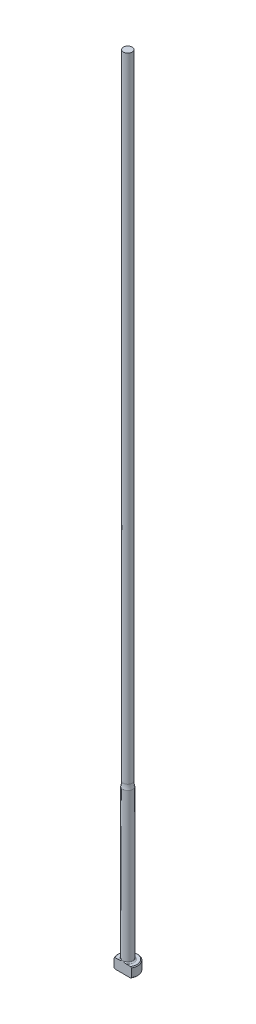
ISO-10303-21;
HEADER;
FILE_DESCRIPTION(('STEP AP214'),'2;1');
FILE_NAME('part.step','',(''),(''),'','','');
FILE_SCHEMA(('AUTOMOTIVE_DESIGN { 1 0 10303 214 1 1 1 1 }'));
ENDSEC;
DATA;
#1=APPLICATION_CONTEXT('core data for automotive mechanical design processes');
#2=APPLICATION_PROTOCOL_DEFINITION('international standard','automotive_design',2000,#1);
#3=PRODUCT_CONTEXT('',#1,'mechanical');
#4=PRODUCT('Part','Part','',(#3));
#5=PRODUCT_RELATED_PRODUCT_CATEGORY('part','',(#4));
#6=PRODUCT_DEFINITION_FORMATION('','',#4);
#7=PRODUCT_DEFINITION_CONTEXT('part definition',#1,'design');
#8=PRODUCT_DEFINITION('design','',#6,#7);
#9=PRODUCT_DEFINITION_SHAPE('','',#8);
#10=(LENGTH_UNIT() NAMED_UNIT(*) SI_UNIT(.MILLI.,.METRE.));
#11=(NAMED_UNIT(*) PLANE_ANGLE_UNIT() SI_UNIT($,.RADIAN.));
#12=(NAMED_UNIT(*) SI_UNIT($,.STERADIAN.) SOLID_ANGLE_UNIT());
#13=UNCERTAINTY_MEASURE_WITH_UNIT(LENGTH_MEASURE(1.E-05),#10,'distance_accuracy_value','');
#14=(GEOMETRIC_REPRESENTATION_CONTEXT(3) GLOBAL_UNCERTAINTY_ASSIGNED_CONTEXT((#13)) GLOBAL_UNIT_ASSIGNED_CONTEXT((#10,
#11,#12)) REPRESENTATION_CONTEXT('',''));
#15=CARTESIAN_POINT('',(0.,0.,0.));
#16=DIRECTION('',(0.,0.,1.));
#17=DIRECTION('',(1.,0.,0.));
#18=AXIS2_PLACEMENT_3D('',#15,#16,#17);
#19=CARTESIAN_POINT('',(-1.38810999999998,254.,0.));
#20=DIRECTION('',(0.,1.,0.));
#21=DIRECTION('',(0.,0.,1.));
#22=AXIS2_PLACEMENT_3D('',#19,#20,#21);
#23=PLANE('',#22);
#24=CARTESIAN_POINT('',(0.,254.,0.));
#25=DIRECTION('',(0.,1.,0.));
#26=DIRECTION('',(0.,0.,1.));
#27=AXIS2_PLACEMENT_3D('',#24,#25,#26);
#28=CIRCLE('',#27,1.38810999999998);
#29=CARTESIAN_POINT('',(0.,254.,1.38810999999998));
#30=VERTEX_POINT('',#29);
#31=EDGE_CURVE('E169',#30,#30,#28,.T.);
#32=ORIENTED_EDGE('',*,*,#31,.T.);
#33=EDGE_LOOP('',(#32));
#34=FACE_BOUND('',#33,.T.);
#35=ADVANCED_FACE('F37',(#34),#23,.T.);
#36=CARTESIAN_POINT('',(0.,259.958771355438,0.));
#37=DIRECTION('',(0.,1.,0.));
#38=DIRECTION('',(0.,0.,1.));
#39=AXIS2_PLACEMENT_3D('',#36,#37,#38);
#40=CYLINDRICAL_SURFACE('',#39,1.38810999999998);
#41=CARTESIAN_POINT('',(0.,52.3787642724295,0.));
#42=DIRECTION('',(0.,1.,0.));
#43=DIRECTION('',(0.,0.,1.));
#44=AXIS2_PLACEMENT_3D('',#41,#42,#43);
#45=CIRCLE('',#44,1.38810999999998);
#46=CARTESIAN_POINT('',(0.,52.3787642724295,1.38810999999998));
#47=VERTEX_POINT('',#46);
#48=EDGE_CURVE('E172',#47,#47,#45,.T.);
#49=ORIENTED_EDGE('',*,*,#48,.T.);
#50=EDGE_LOOP('',(#49));
#51=FACE_BOUND('',#50,.T.);
#52=ORIENTED_EDGE('',*,*,#31,.F.);
#53=EDGE_LOOP('',(#52));
#54=FACE_BOUND('',#53,.T.);
#55=ADVANCED_FACE('F160',(#51,#54),#40,.T.);
#56=CARTESIAN_POINT('',(0.,52.3787642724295,0.));
#57=DIRECTION('',(0.,1.,0.));
#58=DIRECTION('',(0.,0.,1.));
#59=AXIS2_PLACEMENT_3D('',#56,#57,#58);
#60=TOROIDAL_SURFACE('',#59,7.73810999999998,6.35);
#61=CARTESIAN_POINT('',(0.,50.8,0.));
#62=DIRECTION('',(0.,1.,0.));
#63=DIRECTION('',(0.,0.,1.));
#64=AXIS2_PLACEMENT_3D('',#61,#62,#63);
#65=CIRCLE('',#64,1.58749999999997);
#66=CARTESIAN_POINT('',(0.,50.8,1.58749999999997));
#67=VERTEX_POINT('',#66);
#68=EDGE_CURVE('E100',#67,#67,#65,.T.);
#69=ORIENTED_EDGE('',*,*,#68,.T.);
#70=EDGE_LOOP('',(#69));
#71=FACE_BOUND('',#70,.T.);
#72=ORIENTED_EDGE('',*,*,#48,.F.);
#73=EDGE_LOOP('',(#72));
#74=FACE_BOUND('',#73,.T.);
#75=ADVANCED_FACE('F165',(#71,#74),#60,.F.);
#76=CARTESIAN_POINT('',(0.,259.958771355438,0.));
#77=DIRECTION('',(0.,1.,0.));
#78=DIRECTION('',(0.,0.,1.));
#79=AXIS2_PLACEMENT_3D('',#76,#77,#78);
#80=CYLINDRICAL_SURFACE('',#79,1.58749999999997);
#81=CARTESIAN_POINT('',(0.,3.556,0.));
#82=DIRECTION('',(0.,1.,0.));
#83=DIRECTION('',(0.,0.,1.));
#84=AXIS2_PLACEMENT_3D('',#81,#82,#83);
#85=CIRCLE('',#84,1.58749999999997);
#86=CARTESIAN_POINT('',(0.,3.556,1.58749999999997));
#87=VERTEX_POINT('',#86);
#88=EDGE_CURVE('E109',#87,#87,#85,.T.);
#89=ORIENTED_EDGE('',*,*,#88,.T.);
#90=EDGE_LOOP('',(#89));
#91=FACE_BOUND('',#90,.T.);
#92=ORIENTED_EDGE('',*,*,#68,.F.);
#93=EDGE_LOOP('',(#92));
#94=FACE_BOUND('',#93,.T.);
#95=ADVANCED_FACE('F192',(#91,#94),#80,.T.);
#96=CARTESIAN_POINT('',(-3.17499999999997,3.175,0.));
#97=DIRECTION('',(0.,1.,0.));
#98=DIRECTION('',(0.,0.,1.));
#99=AXIS2_PLACEMENT_3D('',#96,#97,#98);
#100=PLANE('',#99);
#101=DIRECTION('',(-1.,0.,0.));
#102=VECTOR('',#101,1.);
#103=CARTESIAN_POINT('',(-3.17499999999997,3.175,1.58749999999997));
#104=LINE('',#103,#102);
#105=CARTESIAN_POINT('',(2.45195529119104,3.175,1.58749999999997));
#106=VERTEX_POINT('',#105);
#107=CARTESIAN_POINT('',(1.16397422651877,3.175,1.58749999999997));
#108=VERTEX_POINT('',#107);
#109=EDGE_CURVE('E58',#106,#108,#104,.T.);
#110=ORIENTED_EDGE('',*,*,#109,.F.);
#111=CARTESIAN_POINT('',(0.,3.175,0.));
#112=DIRECTION('',(0.,1.,0.));
#113=DIRECTION('',(0.,0.,1.));
#114=AXIS2_PLACEMENT_3D('',#111,#112,#113);
#115=CIRCLE('',#114,2.92099999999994);
#116=CARTESIAN_POINT('',(-2.45195529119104,3.175,1.58749999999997));
#117=VERTEX_POINT('',#116);
#118=EDGE_CURVE('E171',#106,#117,#115,.T.);
#119=ORIENTED_EDGE('',*,*,#118,.T.);
#120=CARTESIAN_POINT('',(-1.16397422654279,3.175,1.58749999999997));
#121=VERTEX_POINT('',#120);
#122=EDGE_CURVE('E140',#121,#117,#104,.T.);
#123=ORIENTED_EDGE('',*,*,#122,.F.);
#124=CARTESIAN_POINT('',(0.,3.175,0.));
#125=DIRECTION('',(0.,1.,0.));
#126=DIRECTION('',(0.,0.,1.));
#127=AXIS2_PLACEMENT_3D('',#124,#125,#126);
#128=CIRCLE('',#127,1.96849999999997);
#129=EDGE_CURVE('E113',#121,#108,#128,.F.);
#130=ORIENTED_EDGE('',*,*,#129,.T.);
#131=EDGE_LOOP('',(#110,#119,#123,#130));
#132=FACE_BOUND('',#131,.T.);
#133=ADVANCED_FACE('F189',(#132),#100,.T.);
#134=CARTESIAN_POINT('',(0.,259.958771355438,0.));
#135=DIRECTION('',(0.,1.,0.));
#136=DIRECTION('',(0.,0.,1.));
#137=AXIS2_PLACEMENT_3D('',#134,#135,#136);
#138=CYLINDRICAL_SURFACE('',#137,3.17499999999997);
#139=DIRECTION('',(0.,-1.,0.));
#140=VECTOR('',#139,1.);
#141=CARTESIAN_POINT('',(-2.74963065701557,254.,1.58749999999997));
#142=LINE('',#141,#140);
#143=CARTESIAN_POINT('',(-2.74963065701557,2.92100000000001,1.58749999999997));
#144=VERTEX_POINT('',#143);
#145=CARTESIAN_POINT('',(-2.74963065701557,0.253999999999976,1.58749999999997));
#146=VERTEX_POINT('',#145);
#147=EDGE_CURVE('E95',#144,#146,#142,.T.);
#148=ORIENTED_EDGE('',*,*,#147,.F.);
#149=CARTESIAN_POINT('',(0.,2.92100000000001,0.));
#150=DIRECTION('',(0.,1.,0.));
#151=DIRECTION('',(0.,0.,1.));
#152=AXIS2_PLACEMENT_3D('',#149,#150,#151);
#153=CIRCLE('',#152,3.17499999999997);
#154=CARTESIAN_POINT('',(2.74963065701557,2.92100000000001,1.58749999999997));
#155=VERTEX_POINT('',#154);
#156=EDGE_CURVE('E110',#144,#155,#153,.F.);
#157=ORIENTED_EDGE('',*,*,#156,.T.);
#158=DIRECTION('',(0.,-1.,0.));
#159=VECTOR('',#158,1.);
#160=CARTESIAN_POINT('',(2.74963065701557,254.,1.58749999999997));
#161=LINE('',#160,#159);
#162=CARTESIAN_POINT('',(2.74963065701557,0.253999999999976,1.58749999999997));
#163=VERTEX_POINT('',#162);
#164=EDGE_CURVE('E182',#155,#163,#161,.T.);
#165=ORIENTED_EDGE('',*,*,#164,.T.);
#166=CARTESIAN_POINT('',(0.,0.253999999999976,0.));
#167=DIRECTION('',(0.,-1.,0.));
#168=DIRECTION('',(0.,0.,-1.));
#169=AXIS2_PLACEMENT_3D('',#166,#167,#168);
#170=CIRCLE('',#169,3.17499999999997);
#171=EDGE_CURVE('E116',#163,#146,#170,.F.);
#172=ORIENTED_EDGE('',*,*,#171,.T.);
#173=EDGE_LOOP('',(#148,#157,#165,#172));
#174=FACE_BOUND('',#173,.T.);
#175=ADVANCED_FACE('F180',(#174),#138,.T.);
#176=CARTESIAN_POINT('',(0.,0.,0.));
#177=DIRECTION('',(0.,-1.,0.));
#178=DIRECTION('',(0.,0.,-1.));
#179=AXIS2_PLACEMENT_3D('',#176,#177,#178);
#180=PLANE('',#179);
#181=DIRECTION('',(1.,0.,0.));
#182=VECTOR('',#181,1.);
#183=CARTESIAN_POINT('',(-2.74963065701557,0.,1.58749999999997));
#184=LINE('',#183,#182);
#185=CARTESIAN_POINT('',(-2.45195529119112,0.,1.58749999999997));
#186=VERTEX_POINT('',#185);
#187=CARTESIAN_POINT('',(2.45195529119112,0.,1.58749999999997));
#188=VERTEX_POINT('',#187);
#189=EDGE_CURVE('E92',#186,#188,#184,.T.);
#190=ORIENTED_EDGE('',*,*,#189,.F.);
#191=CARTESIAN_POINT('',(0.,0.,0.));
#192=DIRECTION('',(0.,-1.,0.));
#193=DIRECTION('',(0.,0.,-1.));
#194=AXIS2_PLACEMENT_3D('',#191,#192,#193);
#195=CIRCLE('',#194,2.92100000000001);
#196=EDGE_CURVE('E106',#186,#188,#195,.T.);
#197=ORIENTED_EDGE('',*,*,#196,.T.);
#198=EDGE_LOOP('',(#190,#197));
#199=FACE_BOUND('',#198,.T.);
#200=ADVANCED_FACE('F105',(#199),#180,.T.);
#201=CARTESIAN_POINT('',(0.,3.17499999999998,0.));
#202=DIRECTION('',(0.,-1.,0.));
#203=DIRECTION('',(0.,0.,-1.));
#204=AXIS2_PLACEMENT_3D('',#201,#202,#203);
#205=CONICAL_SURFACE('',#204,2.92099999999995,0.785398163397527);
#206=CARTESIAN_POINT('',(2.75033065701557,2.9203937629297,1.58749999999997));
#207=CARTESIAN_POINT('',(2.66887796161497,2.99091042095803,1.58749999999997));
#208=CARTESIAN_POINT('',(2.58705989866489,3.0610138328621,1.58749999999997));
#209=CARTESIAN_POINT('',(2.42241022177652,3.20009957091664,1.58749999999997));
#210=CARTESIAN_POINT('',(2.33957813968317,3.26908134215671,1.58749999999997));
#211=CARTESIAN_POINT('',(2.17073968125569,3.40716024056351,1.58749999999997));
#212=CARTESIAN_POINT('',(2.08470440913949,3.47622217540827,1.58749999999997));
#213=CARTESIAN_POINT('',(1.91099881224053,3.61222325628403,1.58749999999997));
#214=CARTESIAN_POINT('',(1.82332890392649,3.67916293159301,1.58749999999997));
#215=CARTESIAN_POINT('',(1.64569223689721,3.8102066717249,1.58749999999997));
#216=CARTESIAN_POINT('',(1.55572245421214,3.8743066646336,1.58749999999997));
#217=CARTESIAN_POINT('',(1.37280394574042,3.99833089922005,1.58749999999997));
#218=CARTESIAN_POINT('',(1.27985285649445,4.05825170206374,1.58749999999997));
#219=CARTESIAN_POINT('',(1.09086561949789,4.17130826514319,1.58749999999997));
#220=CARTESIAN_POINT('',(0.994859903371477,4.22449421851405,1.58749999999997));
#221=CARTESIAN_POINT('',(0.798114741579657,4.32122233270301,1.58749999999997));
#222=CARTESIAN_POINT('',(0.697384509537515,4.36478238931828,1.58749999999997));
#223=CARTESIAN_POINT('',(0.541185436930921,4.41951656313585,1.58749999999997));
#224=CARTESIAN_POINT('',(0.487627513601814,4.43611950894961,1.58749999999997));
#225=CARTESIAN_POINT('',(0.379267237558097,4.46466012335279,1.58749999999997));
#226=CARTESIAN_POINT('',(0.324465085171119,4.4765985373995,1.58749999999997));
#227=CARTESIAN_POINT('',(0.214272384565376,4.49501904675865,1.58749999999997));
#228=CARTESIAN_POINT('',(0.158887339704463,4.50153345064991,1.58749999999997));
#229=CARTESIAN_POINT('',(0.047736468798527,4.5087502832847,1.58749999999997));
#230=CARTESIAN_POINT('',(-0.00802931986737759,4.50945327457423,1.58749999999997));
#231=CARTESIAN_POINT('',(-0.119372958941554,4.50499163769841,1.58749999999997));
#232=CARTESIAN_POINT('',(-0.174950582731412,4.49982147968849,1.58749999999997));
#233=CARTESIAN_POINT('',(-0.285312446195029,4.48399101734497,1.58749999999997));
#234=CARTESIAN_POINT('',(-0.340096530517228,4.4733296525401,1.58749999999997));
#235=CARTESIAN_POINT('',(-0.448865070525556,4.44711334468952,1.58749999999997));
#236=CARTESIAN_POINT('',(-0.502841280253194,4.43152477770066,1.58749999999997));
#237=CARTESIAN_POINT('',(-0.609429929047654,4.39628553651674,1.58749999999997));
#238=CARTESIAN_POINT('',(-0.662042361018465,4.37663484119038,1.58749999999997));
#239=CARTESIAN_POINT('',(-0.778129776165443,4.32902110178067,1.58749999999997));
#240=CARTESIAN_POINT('',(-0.841245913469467,4.30019026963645,1.58749999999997));
#241=CARTESIAN_POINT('',(-0.96559457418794,4.23868811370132,1.58749999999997));
#242=CARTESIAN_POINT('',(-1.02682597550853,4.20601455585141,1.58749999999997));
#243=CARTESIAN_POINT('',(-1.14774341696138,4.13769010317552,1.58749999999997));
#244=CARTESIAN_POINT('',(-1.20742632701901,4.10203371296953,1.58749999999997));
#245=CARTESIAN_POINT('',(-1.32539130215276,4.02846531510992,1.58749999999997));
#246=CARTESIAN_POINT('',(-1.38367308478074,3.99055285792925,1.58749999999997));
#247=CARTESIAN_POINT('',(-1.55734442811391,3.87382704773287,1.58749999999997));
#248=CARTESIAN_POINT('',(-1.6709584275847,3.79237897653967,1.58749999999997));
#249=CARTESIAN_POINT('',(-1.89475235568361,3.62521862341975,1.58749999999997));
#250=CARTESIAN_POINT('',(-2.00493591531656,3.53951111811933,1.58749999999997));
#251=CARTESIAN_POINT('',(-2.22248693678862,3.36554942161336,1.58749999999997));
#252=CARTESIAN_POINT('',(-2.32986450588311,3.27730782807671,1.58749999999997));
#253=CARTESIAN_POINT('',(-2.48909538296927,3.14389342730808,1.58749999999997));
#254=CARTESIAN_POINT('',(-2.54159338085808,3.09948435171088,1.58749999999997));
#255=CARTESIAN_POINT('',(-2.64622282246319,3.01024124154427,1.58749999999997));
#256=CARTESIAN_POINT('',(-2.69835428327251,2.96540722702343,1.58749999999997));
#257=CARTESIAN_POINT('',(-2.75033065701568,2.92039376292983,1.58749999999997));
#258=B_SPLINE_CURVE_WITH_KNOTS('',3,(#206,#207,#208,#209,#210,#211,#212,#213,#214,#215,#216,
#217,#218,#219,#220,#221,#222,#223,#224,#225,#226,#227,#228,#229,#230,#231,#232,#233,#234,#235,
#236,#237,#238,#239,#240,#241,#242,#243,#244,#245,#246,#247,#248,#249,#250,#251,#252,#253,#254,
#255,#256,#257),.UNSPECIFIED.,.F.,.F.,(4,2,2,2,2,2,2,2,2,2,2,2,2,2,2,2,2,2,2,2,2,2,2,2,2,4),(0.,
0.323216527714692,0.64658837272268,0.97753957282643,1.30840757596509,1.639735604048,
1.97133312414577,2.30029221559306,2.62863448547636,2.79668277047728,2.96470418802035,
3.13171746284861,3.29871457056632,3.46586904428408,3.63305581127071,3.80140905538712,
3.96976317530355,4.17775353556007,4.38586541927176,4.59436953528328,4.80291533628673,
5.22209642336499,5.64081759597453,6.0577303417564,6.26401477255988,6.47028951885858),.UNSPECIFIED.);
#259=EDGE_CURVE('E63',#155,#106,#258,.T.);
#260=ORIENTED_EDGE('',*,*,#259,.F.);
#261=ORIENTED_EDGE('',*,*,#156,.F.);
#262=EDGE_CURVE('E133',#117,#144,#258,.T.);
#263=ORIENTED_EDGE('',*,*,#262,.F.);
#264=ORIENTED_EDGE('',*,*,#118,.F.);
#265=EDGE_LOOP('',(#260,#261,#263,#264));
#266=FACE_BOUND('',#265,.T.);
#267=ADVANCED_FACE('F147',(#266),#205,.T.);
#268=CARTESIAN_POINT('',(0.,0.253999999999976,0.));
#269=DIRECTION('',(0.,1.,0.));
#270=DIRECTION('',(0.,0.,1.));
#271=AXIS2_PLACEMENT_3D('',#268,#269,#270);
#272=CONICAL_SURFACE('',#271,3.17499999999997,0.785398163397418);
#273=CARTESIAN_POINT('',(-2.75033065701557,0.254606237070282,1.58749999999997));
#274=CARTESIAN_POINT('',(-2.66887796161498,0.184089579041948,1.58749999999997));
#275=CARTESIAN_POINT('',(-2.58705989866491,0.113986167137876,1.58749999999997));
#276=CARTESIAN_POINT('',(-2.42241022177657,-0.0250995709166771,1.58749999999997));
#277=CARTESIAN_POINT('',(-2.33957813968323,-0.0940813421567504,1.58749999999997));
#278=CARTESIAN_POINT('',(-2.17073968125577,-0.232160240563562,1.58749999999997));
#279=CARTESIAN_POINT('',(-2.08470440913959,-0.301222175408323,1.58749999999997));
#280=CARTESIAN_POINT('',(-1.91099881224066,-0.437223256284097,1.58749999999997));
#281=CARTESIAN_POINT('',(-1.82332890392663,-0.50416293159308,1.58749999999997));
#282=CARTESIAN_POINT('',(-1.64569223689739,-0.635206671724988,1.58749999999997));
#283=CARTESIAN_POINT('',(-1.55572245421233,-0.699306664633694,1.58749999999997));
#284=CARTESIAN_POINT('',(-1.37280394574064,-0.823330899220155,1.58749999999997));
#285=CARTESIAN_POINT('',(-1.27985285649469,-0.883251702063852,1.58749999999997));
#286=CARTESIAN_POINT('',(-1.09086561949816,-0.996308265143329,1.58749999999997));
#287=CARTESIAN_POINT('',(-0.994859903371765,-1.0494942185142,1.58749999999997));
#288=CARTESIAN_POINT('',(-0.798114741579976,-1.14622233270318,1.58749999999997));
#289=CARTESIAN_POINT('',(-0.697384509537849,-1.18978238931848,1.58749999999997));
#290=CARTESIAN_POINT('',(-0.54118543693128,-1.24451656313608,1.58749999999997));
#291=CARTESIAN_POINT('',(-0.487627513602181,-1.26111950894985,1.58749999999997));
#292=CARTESIAN_POINT('',(-0.379267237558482,-1.28966012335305,1.58749999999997));
#293=CARTESIAN_POINT('',(-0.324465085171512,-1.30159853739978,1.58749999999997));
#294=CARTESIAN_POINT('',(-0.214272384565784,-1.32001904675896,1.58749999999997));
#295=CARTESIAN_POINT('',(-0.158887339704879,-1.32653345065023,1.58749999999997));
#296=CARTESIAN_POINT('',(-0.0477364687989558,-1.33375028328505,1.58749999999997));
#297=CARTESIAN_POINT('',(0.00802931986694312,-1.33445327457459,1.58749999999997));
#298=CARTESIAN_POINT('',(0.119372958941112,-1.32999163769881,1.58749999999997));
#299=CARTESIAN_POINT('',(0.174950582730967,-1.3248214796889,1.58749999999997));
#300=CARTESIAN_POINT('',(0.28531244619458,-1.30899101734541,1.58749999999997));
#301=CARTESIAN_POINT('',(0.340096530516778,-1.29832965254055,1.58749999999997));
#302=CARTESIAN_POINT('',(0.448865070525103,-1.27211334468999,1.58749999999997));
#303=CARTESIAN_POINT('',(0.50284128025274,-1.25652477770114,1.58749999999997));
#304=CARTESIAN_POINT('',(0.609429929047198,-1.22128553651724,1.58749999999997));
#305=CARTESIAN_POINT('',(0.662042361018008,-1.20163484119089,1.58749999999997));
#306=CARTESIAN_POINT('',(0.778129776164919,-1.15402110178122,1.58749999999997));
#307=CARTESIAN_POINT('',(0.841245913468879,-1.12519026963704,1.58749999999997));
#308=CARTESIAN_POINT('',(0.965594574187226,-1.06368811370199,1.58749999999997));
#309=CARTESIAN_POINT('',(1.02682597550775,-1.03101455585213,1.58749999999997));
#310=CARTESIAN_POINT('',(1.14774341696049,-0.962690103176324,1.58749999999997));
#311=CARTESIAN_POINT('',(1.20742632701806,-0.927033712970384,1.58749999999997));
#312=CARTESIAN_POINT('',(1.32539130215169,-0.85346531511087,1.58749999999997));
#313=CARTESIAN_POINT('',(1.38367308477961,-0.815552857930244,1.58749999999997));
#314=CARTESIAN_POINT('',(1.5573444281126,-0.698827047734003,1.58749999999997));
#315=CARTESIAN_POINT('',(1.67095842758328,-0.617378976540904,1.58749999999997));
#316=CARTESIAN_POINT('',(1.89475235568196,-0.45021862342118,1.58749999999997));
#317=CARTESIAN_POINT('',(2.0049359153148,-0.364511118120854,1.58749999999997));
#318=CARTESIAN_POINT('',(2.22248693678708,-0.19054942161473,1.58749999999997));
#319=CARTESIAN_POINT('',(2.3298645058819,-0.102307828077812,1.58749999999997));
#320=CARTESIAN_POINT('',(2.48909538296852,0.0311065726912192,1.58749999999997));
#321=CARTESIAN_POINT('',(2.54159338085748,0.0755156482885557,1.58749999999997));
#322=CARTESIAN_POINT('',(2.64622282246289,0.16475875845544,1.58749999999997));
#323=CARTESIAN_POINT('',(2.69835428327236,0.209592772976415,1.58749999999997));
#324=CARTESIAN_POINT('',(2.75033065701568,0.254606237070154,1.58749999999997));
#325=B_SPLINE_CURVE_WITH_KNOTS('',3,(#273,#274,#275,#276,#277,#278,#279,#280,#281,#282,#283,
#284,#285,#286,#287,#288,#289,#290,#291,#292,#293,#294,#295,#296,#297,#298,#299,#300,#301,#302,
#303,#304,#305,#306,#307,#308,#309,#310,#311,#312,#313,#314,#315,#316,#317,#318,#319,#320,#321,
#322,#323,#324),.UNSPECIFIED.,.F.,.F.,(4,2,2,2,2,2,2,2,2,2,2,2,2,2,2,2,2,2,2,2,2,2,2,2,2,4),(0.,
0.323216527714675,0.646588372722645,0.977539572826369,1.308407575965,1.63973560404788,
1.97133312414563,2.3002922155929,2.62863448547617,2.79668277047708,2.96470418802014,
3.13171746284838,3.29871457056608,3.46586904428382,3.63305581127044,3.80140905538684,
3.96976317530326,4.17775353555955,4.38586541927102,4.59436953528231,4.80291533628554,
5.22209642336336,5.64081759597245,6.05773034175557,6.26401477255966,6.47028951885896),.UNSPECIFIED.);
#326=EDGE_CURVE('E89',#146,#186,#325,.T.);
#327=ORIENTED_EDGE('',*,*,#326,.F.);
#328=ORIENTED_EDGE('',*,*,#171,.F.);
#329=EDGE_CURVE('E101',#188,#163,#325,.T.);
#330=ORIENTED_EDGE('',*,*,#329,.F.);
#331=ORIENTED_EDGE('',*,*,#196,.F.);
#332=EDGE_LOOP('',(#327,#328,#330,#331));
#333=FACE_BOUND('',#332,.T.);
#334=ADVANCED_FACE('F108',(#333),#272,.T.);
#335=CARTESIAN_POINT('',(0.,3.556,0.));
#336=DIRECTION('',(0.,1.,0.));
#337=DIRECTION('',(0.,0.,1.));
#338=AXIS2_PLACEMENT_3D('',#335,#336,#337);
#339=TOROIDAL_SURFACE('',#338,1.96849999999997,0.381);
#340=ORIENTED_EDGE('',*,*,#129,.F.);
#341=CARTESIAN_POINT('',(0.,3.556,1.58749999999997));
#342=CARTESIAN_POINT('',(-9.72836981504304E-12,3.55600071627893,1.58749999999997));
#343=CARTESIAN_POINT('',(-1.16390048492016E-07,3.55600143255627,1.58749999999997));
#344=CARTESIAN_POINT('',(-5.02802253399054E-07,3.55600282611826,1.58749999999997));
#345=CARTESIAN_POINT('',(-7.75049116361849E-07,3.55600350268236,1.58749999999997));
#346=CARTESIAN_POINT('',(-1.43578185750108E-06,3.5560048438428,1.58749999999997));
#347=CARTESIAN_POINT('',(-1.83004116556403E-06,3.55600550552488,1.58749999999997));
#348=CARTESIAN_POINT('',(-2.69326525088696E-06,3.55600677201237,1.58749999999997));
#349=CARTESIAN_POINT('',(-3.16190628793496E-06,3.55600737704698,1.58749999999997));
#350=CARTESIAN_POINT('',(-4.80183833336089E-06,3.55600933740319,1.58749999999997));
#351=CARTESIAN_POINT('',(-6.07237548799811E-06,3.55601061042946,1.58749999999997));
#352=CARTESIAN_POINT('',(-8.74131694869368E-06,3.55601293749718,1.58749999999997));
#353=CARTESIAN_POINT('',(-1.01362054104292E-05,3.55601399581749,1.58749999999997));
#354=CARTESIAN_POINT('',(-1.54025644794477E-05,3.55601779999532,1.58749999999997));
#355=CARTESIAN_POINT('',(-1.94297992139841E-05,3.55602033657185,1.58749999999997));
#356=CARTESIAN_POINT('',(-2.75116574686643E-05,3.55602464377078,1.58749999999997));
#357=CARTESIAN_POINT('',(-3.15456374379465E-05,3.55602645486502,1.58749999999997));
#358=CARTESIAN_POINT('',(-4.82039076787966E-05,3.55603383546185,1.58749999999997));
#359=CARTESIAN_POINT('',(-6.08993138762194E-05,3.55603922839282,1.58749999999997));
#360=CARTESIAN_POINT('',(-8.49758225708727E-05,3.55604818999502,1.58749999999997));
#361=CARTESIAN_POINT('',(-9.62998311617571E-05,3.55605190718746,1.58749999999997));
#362=CARTESIAN_POINT('',(-0.000176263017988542,3.55608045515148,1.58749999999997));
#363=CARTESIAN_POINT('',(-0.000240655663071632,3.55611569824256,1.58749999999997));
#364=CARTESIAN_POINT('',(-0.000487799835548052,3.55624580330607,1.58749999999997));
#365=CARTESIAN_POINT('',(-0.00067351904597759,3.55633293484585,1.58749999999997));
#366=CARTESIAN_POINT('',(-0.00138308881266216,3.55667103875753,1.58749999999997));
#367=CARTESIAN_POINT('',(-0.00190387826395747,3.55693009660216,1.58749999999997));
#368=CARTESIAN_POINT('',(-0.00399959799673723,3.55796727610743,1.58749999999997));
#369=CARTESIAN_POINT('',(-0.00557790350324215,3.55873636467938,1.58749999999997));
#370=CARTESIAN_POINT('',(-0.0382341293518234,3.57465580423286,1.58749999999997));
#371=CARTESIAN_POINT('',(-0.0692744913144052,3.58990875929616,1.58749999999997));
#372=CARTESIAN_POINT('',(-0.130397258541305,3.61965968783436,1.58749999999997));
#373=CARTESIAN_POINT('',(-0.160476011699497,3.63416561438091,1.58749999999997));
#374=CARTESIAN_POINT('',(-0.224053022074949,3.66443420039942,1.58749999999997));
#375=CARTESIAN_POINT('',(-0.257567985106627,3.68016231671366,1.58749999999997));
#376=CARTESIAN_POINT('',(-0.325196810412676,3.71115684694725,1.58749999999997));
#377=CARTESIAN_POINT('',(-0.359313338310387,3.72641747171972,1.58749999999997));
#378=CARTESIAN_POINT('',(-0.419670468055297,3.75252155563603,1.58749999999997));
#379=CARTESIAN_POINT('',(-0.445832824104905,3.76354497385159,1.58749999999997));
#380=CARTESIAN_POINT('',(-0.498343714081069,3.78496139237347,1.58749999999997));
#381=CARTESIAN_POINT('',(-0.52469168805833,3.79535577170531,1.58749999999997));
#382=CARTESIAN_POINT('',(-0.603098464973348,3.82505921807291,1.58749999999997));
#383=CARTESIAN_POINT('',(-0.655557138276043,3.84334682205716,1.58749999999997));
#384=CARTESIAN_POINT('',(-0.737608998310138,3.86867530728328,1.58749999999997));
#385=CARTESIAN_POINT('',(-0.766787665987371,3.87705653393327,1.58749999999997));
#386=CARTESIAN_POINT('',(-0.825628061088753,3.89250520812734,1.58749999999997));
#387=CARTESIAN_POINT('',(-0.855291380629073,3.89956651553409,1.58749999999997));
#388=CARTESIAN_POINT('',(-0.947623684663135,3.91896724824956,1.58749999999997));
#389=CARTESIAN_POINT('',(-1.01091582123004,3.92863515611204,1.58749999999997));
#390=CARTESIAN_POINT('',(-1.12491727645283,3.93735173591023,1.58749999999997));
#391=CARTESIAN_POINT('',(-1.17548103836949,3.93820257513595,1.58749999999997));
#392=CARTESIAN_POINT('',(-1.2756075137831,3.93219174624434,1.58749999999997));
#393=CARTESIAN_POINT('',(-1.32517446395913,3.92543532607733,1.58749999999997));
#394=CARTESIAN_POINT('',(-1.40268723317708,3.90689937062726,1.58749999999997));
#395=CARTESIAN_POINT('',(-1.43136704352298,3.8982006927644,1.58749999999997));
#396=CARTESIAN_POINT('',(-1.48727388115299,3.87676152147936,1.58749999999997));
#397=CARTESIAN_POINT('',(-1.51449910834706,3.86401614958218,1.58749999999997));
#398=CARTESIAN_POINT('',(-1.56082978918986,3.83720110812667,1.58749999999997));
#399=CARTESIAN_POINT('',(-1.5804296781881,3.82399155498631,1.58749999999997));
#400=CARTESIAN_POINT('',(-1.61726850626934,3.79461258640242,1.58749999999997));
#401=CARTESIAN_POINT('',(-1.63451177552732,3.77844873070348,1.58749999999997));
#402=CARTESIAN_POINT('',(-1.66235366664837,3.74697901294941,1.58749999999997));
#403=CARTESIAN_POINT('',(-1.67358404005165,3.73223408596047,1.58749999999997));
#404=CARTESIAN_POINT('',(-1.69348690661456,3.70109350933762,1.58749999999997));
#405=CARTESIAN_POINT('',(-1.70216040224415,3.68469851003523,1.58749999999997));
#406=CARTESIAN_POINT('',(-1.71647536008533,3.65047412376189,1.58749999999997));
#407=CARTESIAN_POINT('',(-1.72209384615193,3.63263499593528,1.58749999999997));
#408=CARTESIAN_POINT('',(-1.72977101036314,3.59620550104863,1.58749999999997));
#409=CARTESIAN_POINT('',(-1.73183223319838,3.57761568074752,1.58749999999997));
#410=CARTESIAN_POINT('',(-1.73220894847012,3.54269507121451,1.58749999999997));
#411=CARTESIAN_POINT('',(-1.73095378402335,3.52636752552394,1.58749999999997));
#412=CARTESIAN_POINT('',(-1.72566824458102,3.49417280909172,1.58749999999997));
#413=CARTESIAN_POINT('',(-1.72163817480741,3.47830558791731,1.58749999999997));
#414=CARTESIAN_POINT('',(-1.71112762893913,3.44769086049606,1.58749999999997));
#415=CARTESIAN_POINT('',(-1.70468621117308,3.43292978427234,1.58749999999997));
#416=CARTESIAN_POINT('',(-1.68967506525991,3.40454102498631,1.58749999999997));
#417=CARTESIAN_POINT('',(-1.68110458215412,3.39091374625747,1.58749999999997));
#418=CARTESIAN_POINT('',(-1.6586320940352,3.36009164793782,1.58749999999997));
#419=CARTESIAN_POINT('',(-1.64393589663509,3.34347475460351,1.58749999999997));
#420=CARTESIAN_POINT('',(-1.61203006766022,3.31284923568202,1.58749999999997));
#421=CARTESIAN_POINT('',(-1.59481484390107,3.29884657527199,1.58749999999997));
#422=CARTESIAN_POINT('',(-1.55180967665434,3.26864697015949,1.58749999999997));
#423=CARTESIAN_POINT('',(-1.52522183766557,3.25359002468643,1.58749999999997));
#424=CARTESIAN_POINT('',(-1.47008223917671,3.22790710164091,1.58749999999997));
#425=CARTESIAN_POINT('',(-1.44153163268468,3.21727854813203,1.58749999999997));
#426=CARTESIAN_POINT('',(-1.36850699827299,3.19543087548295,1.58749999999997));
#427=CARTESIAN_POINT('',(-1.32330828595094,3.18665188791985,1.58749999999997));
#428=CARTESIAN_POINT('',(-1.23163561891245,3.17601019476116,1.58749999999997));
#429=CARTESIAN_POINT('',(-1.18515271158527,3.17423987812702,1.58749999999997));
#430=CARTESIAN_POINT('',(-1.05662630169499,3.17714275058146,1.58749999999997));
#431=CARTESIAN_POINT('',(-0.974728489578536,3.18781881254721,1.58749999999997));
#432=CARTESIAN_POINT('',(-0.855941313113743,3.21210673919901,1.58749999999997));
#433=CARTESIAN_POINT('',(-0.817952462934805,3.22124962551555,1.58749999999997));
#434=CARTESIAN_POINT('',(-0.742758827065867,3.24165077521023,1.58749999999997));
#435=CARTESIAN_POINT('',(-0.70555083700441,3.25289687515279,1.58749999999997));
#436=CARTESIAN_POINT('',(-0.61890080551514,3.28132261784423,1.58749999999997));
#437=CARTESIAN_POINT('',(-0.569693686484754,3.29920707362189,1.58749999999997));
#438=CARTESIAN_POINT('',(-0.496059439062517,3.32795584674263,1.58749999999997));
#439=CARTESIAN_POINT('',(-0.471293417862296,3.33797105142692,1.58749999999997));
#440=CARTESIAN_POINT('',(-0.421913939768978,3.35852833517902,1.58749999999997));
#441=CARTESIAN_POINT('',(-0.397300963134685,3.36907157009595,1.58749999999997));
#442=CARTESIAN_POINT('',(-0.340371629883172,3.39402532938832,1.58749999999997));
#443=CARTESIAN_POINT('',(-0.308122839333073,3.40858936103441,1.58749999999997));
#444=CARTESIAN_POINT('',(-0.244169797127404,3.43810365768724,1.58749999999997));
#445=CARTESIAN_POINT('',(-0.212463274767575,3.45304902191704,1.58749999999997));
#446=CARTESIAN_POINT('',(-0.152300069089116,3.48177412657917,1.58749999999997));
#447=CARTESIAN_POINT('',(-0.123829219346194,3.49552467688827,1.58749999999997));
#448=CARTESIAN_POINT('',(-0.0659674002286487,3.52370941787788,1.58749999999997));
#449=CARTESIAN_POINT('',(-0.0365796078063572,3.53815055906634,1.58749999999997));
#450=CARTESIAN_POINT('',(-0.00557801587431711,3.55326358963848,1.58749999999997));
#451=CARTESIAN_POINT('',(-0.00399981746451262,3.55403261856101,1.58749999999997));
#452=CARTESIAN_POINT('',(-0.0019041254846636,3.55506978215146,1.58749999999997));
#453=CARTESIAN_POINT('',(-0.00138325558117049,3.55532888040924,1.58749999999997));
#454=CARTESIAN_POINT('',(-0.000673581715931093,3.55566703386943,1.58749999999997));
#455=CARTESIAN_POINT('',(-0.000487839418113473,3.55575417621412,1.58749999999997));
#456=CARTESIAN_POINT('',(-0.000240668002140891,3.55588429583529,1.58749999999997));
#457=CARTESIAN_POINT('',(-0.00017627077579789,3.55591954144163,1.58749999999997));
#458=CARTESIAN_POINT('',(-9.63021903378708E-05,3.55594809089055,1.58749999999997));
#459=CARTESIAN_POINT('',(-8.49777827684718E-05,3.55595180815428,1.58749999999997));
#460=CARTESIAN_POINT('',(-6.09004217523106E-05,3.55596077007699,1.58749999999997));
#461=CARTESIAN_POINT('',(-4.8204572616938E-05,3.55596616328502,1.58749999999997));
#462=CARTESIAN_POINT('',(-3.15458034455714E-05,3.55597354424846,1.58749999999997));
#463=CARTESIAN_POINT('',(-2.75117552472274E-05,3.55597535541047,1.58749999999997));
#464=CARTESIAN_POINT('',(-1.94297725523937E-05,3.55597966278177,1.58749999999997));
#465=CARTESIAN_POINT('',(-1.54024835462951E-05,3.55598219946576,1.58749999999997));
#466=CARTESIAN_POINT('',(-1.01360754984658E-05,3.5559860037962,1.58749999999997));
#467=CARTESIAN_POINT('',(-8.74118137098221E-06,3.55598706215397,1.58749999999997));
#468=CARTESIAN_POINT('',(-6.07223627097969E-06,3.55598938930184,1.58749999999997));
#469=CARTESIAN_POINT('',(-4.80170138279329E-06,3.55599066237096,1.58749999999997));
#470=CARTESIAN_POINT('',(-3.16178168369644E-06,3.55599262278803,1.58749999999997));
#471=CARTESIAN_POINT('',(-2.69314603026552E-06,3.55599322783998,1.58749999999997));
#472=CARTESIAN_POINT('',(-1.82993577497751E-06,3.55599449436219,1.58749999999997));
#473=CARTESIAN_POINT('',(-1.43568493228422E-06,3.55599515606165,1.58749999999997));
#474=CARTESIAN_POINT('',(-7.74972790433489E-07,3.5559964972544,1.58749999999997));
#475=CARTESIAN_POINT('',(-5.0273777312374E-07,3.55599717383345,1.58749999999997));
#476=CARTESIAN_POINT('',(-1.16354060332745E-07,3.55599856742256,1.58749999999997));
#477=CARTESIAN_POINT('',(9.72849210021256E-12,3.55599928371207,1.58749999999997));
#478=CARTESIAN_POINT('',(0.,3.556,1.58749999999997));
#479=B_SPLINE_CURVE_WITH_KNOTS('',3,(#341,#342,#343,#344,#345,#346,#347,#348,#349,#350,#351,
#352,#353,#354,#355,#356,#357,#358,#359,#360,#361,#362,#363,#364,#365,#366,#367,#368,#369,#370,
#371,#372,#373,#374,#375,#376,#377,#378,#379,#380,#381,#382,#383,#384,#385,#386,#387,#388,#389,
#390,#391,#392,#393,#394,#395,#396,#397,#398,#399,#400,#401,#402,#403,#404,#405,#406,#407,#408,
#409,#410,#411,#412,#413,#414,#415,#416,#417,#418,#419,#420,#421,#422,#423,#424,#425,#426,#427,
#428,#429,#430,#431,#432,#433,#434,#435,#436,#437,#438,#439,#440,#441,#442,#443,#444,#445,#446,
#447,#448,#449,#450,#451,#452,#453,#454,#455,#456,#457,#458,#459,#460,#461,#462,#463,#464,#465,
#466,#467,#468,#469,#470,#471,#472,#473,#474,#475,#476,#477,#478),.UNSPECIFIED.,.T.,.F.,(4,2,2,
2,2,2,2,2,2,2,2,2,2,2,2,2,2,2,2,2,2,2,2,2,2,2,2,2,2,2,2,2,2,2,2,2,2,2,2,2,2,2,2,2,2,2,2,2,2,2,2,
2,2,2,2,2,2,2,2,2,2,2,2,2,2,2,2,2,4),(0.,2.14653634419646E-06,4.32436173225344E-06,
6.62715069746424E-06,8.92017875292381E-06,1.42892293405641E-05,1.95376032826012E-05,
3.37616071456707E-05,4.70144492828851E-05,8.83789092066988E-05,0.000124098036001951,
0.000343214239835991,0.000959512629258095,0.00270343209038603,0.00797166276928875,
0.111713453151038,0.21189766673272,0.322958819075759,0.435072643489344,0.520234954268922,
0.605203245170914,0.771741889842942,0.862787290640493,0.954246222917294,1.14571222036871,
1.29701464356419,1.44624921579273,1.53592478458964,1.62570887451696,1.69637166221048,
1.76690281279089,1.82229027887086,1.87765600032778,1.93343255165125,1.98916918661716,
2.03805361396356,2.08693266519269,2.13505202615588,2.18318847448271,2.24937187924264,
2.31570450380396,2.40686174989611,2.49796589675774,2.6353267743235,2.77449244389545,
3.02069049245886,3.13789423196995,3.25444001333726,3.41142684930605,3.49156606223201,
3.57188909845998,3.67803747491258,3.78319074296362,3.87804579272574,3.97626481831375,
3.98153268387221,3.98327687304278,3.98389324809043,3.98411237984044,3.98414810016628,
3.98418946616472,3.98420271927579,3.98421694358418,3.98422219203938,3.9842275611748,
3.98422985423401,3.98423215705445,3.98423433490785,3.98423648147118),.UNSPECIFIED.);
#480=EDGE_CURVE('E11',#121,#87,#479,.T.);
#481=ORIENTED_EDGE('',*,*,#480,.T.);
#482=ORIENTED_EDGE('',*,*,#88,.F.);
#483=CARTESIAN_POINT('',(0.,3.556,1.58749999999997));
#484=CARTESIAN_POINT('',(9.72840018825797E-12,3.55599928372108,1.58749999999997));
#485=CARTESIAN_POINT('',(1.16390048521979E-07,3.55599856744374,1.58749999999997));
#486=CARTESIAN_POINT('',(5.02802253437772E-07,3.55599717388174,1.58749999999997));
#487=CARTESIAN_POINT('',(7.750491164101E-07,3.55599649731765,1.58749999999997));
#488=CARTESIAN_POINT('',(1.43578185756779E-06,3.55599515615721,1.58749999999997));
#489=CARTESIAN_POINT('',(1.83004116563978E-06,3.55599449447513,1.58749999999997));
#490=CARTESIAN_POINT('',(2.69326525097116E-06,3.55599322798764,1.58749999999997));
#491=CARTESIAN_POINT('',(3.16190628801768E-06,3.55599262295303,1.58749999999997));
#492=CARTESIAN_POINT('',(4.80183833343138E-06,3.55599066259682,1.58749999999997));
#493=CARTESIAN_POINT('',(6.07237548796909E-06,3.55598938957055,1.58749999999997));
#494=CARTESIAN_POINT('',(8.74131694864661E-06,3.55598706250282,1.58749999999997));
#495=CARTESIAN_POINT('',(1.013620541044E-05,3.55598600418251,1.58749999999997));
#496=CARTESIAN_POINT('',(1.54025644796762E-05,3.55598220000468,1.58749999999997));
#497=CARTESIAN_POINT('',(1.94297992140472E-05,3.55597966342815,1.58749999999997));
#498=CARTESIAN_POINT('',(2.75116574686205E-05,3.55597535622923,1.58749999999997));
#499=CARTESIAN_POINT('',(3.15456374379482E-05,3.55597354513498,1.58749999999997));
#500=CARTESIAN_POINT('',(4.82039076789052E-05,3.55596616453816,1.58749999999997));
#501=CARTESIAN_POINT('',(6.0899313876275E-05,3.55596077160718,1.58749999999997));
#502=CARTESIAN_POINT('',(8.4975822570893E-05,3.55595181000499,1.58749999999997));
#503=CARTESIAN_POINT('',(9.62998311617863E-05,3.55594809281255,1.58749999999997));
#504=CARTESIAN_POINT('',(0.000176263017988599,3.55591954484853,1.58749999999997));
#505=CARTESIAN_POINT('',(0.000240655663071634,3.55588430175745,1.58749999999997));
#506=CARTESIAN_POINT('',(0.000487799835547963,3.55575419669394,1.58749999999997));
#507=CARTESIAN_POINT('',(0.000673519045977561,3.55566706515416,1.58749999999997));
#508=CARTESIAN_POINT('',(0.00138308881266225,3.55532896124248,1.58749999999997));
#509=CARTESIAN_POINT('',(0.00190387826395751,3.55506990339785,1.58749999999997));
#510=CARTESIAN_POINT('',(0.00399959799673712,3.55403272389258,1.58749999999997));
#511=CARTESIAN_POINT('',(0.00557790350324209,3.55326363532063,1.58749999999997));
#512=CARTESIAN_POINT('',(0.0382341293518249,3.53734419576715,1.58749999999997));
#513=CARTESIAN_POINT('',(0.0692744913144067,3.52209124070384,1.58749999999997));
#514=CARTESIAN_POINT('',(0.130397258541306,3.49234031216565,1.58749999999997));
#515=CARTESIAN_POINT('',(0.160476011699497,3.4778343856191,1.58749999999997));
#516=CARTESIAN_POINT('',(0.22405302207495,3.44756579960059,1.58749999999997));
#517=CARTESIAN_POINT('',(0.257567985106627,3.43183768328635,1.58749999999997));
#518=CARTESIAN_POINT('',(0.325196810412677,3.40084315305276,1.58749999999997));
#519=CARTESIAN_POINT('',(0.359313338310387,3.38558252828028,1.58749999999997));
#520=CARTESIAN_POINT('',(0.419670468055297,3.35947844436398,1.58749999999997));
#521=CARTESIAN_POINT('',(0.445832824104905,3.34845502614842,1.58749999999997));
#522=CARTESIAN_POINT('',(0.498343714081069,3.32703860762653,1.58749999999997));
#523=CARTESIAN_POINT('',(0.52469168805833,3.31664422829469,1.58749999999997));
#524=CARTESIAN_POINT('',(0.603098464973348,3.2869407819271,1.58749999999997));
#525=CARTESIAN_POINT('',(0.655557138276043,3.26865317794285,1.58749999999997));
#526=CARTESIAN_POINT('',(0.737608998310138,3.24332469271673,1.58749999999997));
#527=CARTESIAN_POINT('',(0.766787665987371,3.23494346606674,1.58749999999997));
#528=CARTESIAN_POINT('',(0.825628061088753,3.21949479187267,1.58749999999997));
#529=CARTESIAN_POINT('',(0.855291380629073,3.21243348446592,1.58749999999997));
#530=CARTESIAN_POINT('',(0.947623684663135,3.19303275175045,1.58749999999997));
#531=CARTESIAN_POINT('',(1.01091582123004,3.18336484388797,1.58749999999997));
#532=CARTESIAN_POINT('',(1.12491727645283,3.17464826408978,1.58749999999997));
#533=CARTESIAN_POINT('',(1.17548103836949,3.17379742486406,1.58749999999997));
#534=CARTESIAN_POINT('',(1.2756075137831,3.17980825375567,1.58749999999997));
#535=CARTESIAN_POINT('',(1.32517446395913,3.18656467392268,1.58749999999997));
#536=CARTESIAN_POINT('',(1.40268723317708,3.20510062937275,1.58749999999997));
#537=CARTESIAN_POINT('',(1.43136704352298,3.21379930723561,1.58749999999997));
#538=CARTESIAN_POINT('',(1.48727388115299,3.23523847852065,1.58749999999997));
#539=CARTESIAN_POINT('',(1.51449910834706,3.24798385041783,1.58749999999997));
#540=CARTESIAN_POINT('',(1.56082978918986,3.27479889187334,1.58749999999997));
#541=CARTESIAN_POINT('',(1.5804296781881,3.2880084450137,1.58749999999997));
#542=CARTESIAN_POINT('',(1.61726850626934,3.31738741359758,1.58749999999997));
#543=CARTESIAN_POINT('',(1.63451177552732,3.33355126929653,1.58749999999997));
#544=CARTESIAN_POINT('',(1.66235366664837,3.3650209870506,1.58749999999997));
#545=CARTESIAN_POINT('',(1.67358404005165,3.37976591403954,1.58749999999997));
#546=CARTESIAN_POINT('',(1.69348690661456,3.41090649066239,1.58749999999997));
#547=CARTESIAN_POINT('',(1.70216040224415,3.42730148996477,1.58749999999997));
#548=CARTESIAN_POINT('',(1.71647536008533,3.46152587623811,1.58749999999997));
#549=CARTESIAN_POINT('',(1.72209384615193,3.47936500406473,1.58749999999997));
#550=CARTESIAN_POINT('',(1.72977101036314,3.51579449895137,1.58749999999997));
#551=CARTESIAN_POINT('',(1.73183223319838,3.53438431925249,1.58749999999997));
#552=CARTESIAN_POINT('',(1.73220894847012,3.5693049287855,1.58749999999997));
#553=CARTESIAN_POINT('',(1.73095378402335,3.58563247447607,1.58749999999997));
#554=CARTESIAN_POINT('',(1.72566824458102,3.61782719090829,1.58749999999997));
#555=CARTESIAN_POINT('',(1.72163817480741,3.6336944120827,1.58749999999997));
#556=CARTESIAN_POINT('',(1.71112762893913,3.66430913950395,1.58749999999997));
#557=CARTESIAN_POINT('',(1.70468621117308,3.67907021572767,1.58749999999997));
#558=CARTESIAN_POINT('',(1.68967506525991,3.7074589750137,1.58749999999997));
#559=CARTESIAN_POINT('',(1.68110458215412,3.72108625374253,1.58749999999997));
#560=CARTESIAN_POINT('',(1.6586320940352,3.75190835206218,1.58749999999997));
#561=CARTESIAN_POINT('',(1.64393589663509,3.76852524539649,1.58749999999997));
#562=CARTESIAN_POINT('',(1.61203006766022,3.79915076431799,1.58749999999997));
#563=CARTESIAN_POINT('',(1.59481484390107,3.81315342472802,1.58749999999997));
#564=CARTESIAN_POINT('',(1.55180967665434,3.84335302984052,1.58749999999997));
#565=CARTESIAN_POINT('',(1.52522183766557,3.85840997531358,1.58749999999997));
#566=CARTESIAN_POINT('',(1.47008223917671,3.8840928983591,1.58749999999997));
#567=CARTESIAN_POINT('',(1.44153163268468,3.89472145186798,1.58749999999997));
#568=CARTESIAN_POINT('',(1.36850699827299,3.91656912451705,1.58749999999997));
#569=CARTESIAN_POINT('',(1.32330828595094,3.92534811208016,1.58749999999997));
#570=CARTESIAN_POINT('',(1.23163561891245,3.93598980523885,1.58749999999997));
#571=CARTESIAN_POINT('',(1.18515271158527,3.93776012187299,1.58749999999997));
#572=CARTESIAN_POINT('',(1.05662630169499,3.93485724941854,1.58749999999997));
#573=CARTESIAN_POINT('',(0.974728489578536,3.9241811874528,1.58749999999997));
#574=CARTESIAN_POINT('',(0.855941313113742,3.899893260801,1.58749999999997));
#575=CARTESIAN_POINT('',(0.817952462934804,3.89075037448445,1.58749999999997));
#576=CARTESIAN_POINT('',(0.742758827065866,3.87034922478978,1.58749999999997));
#577=CARTESIAN_POINT('',(0.705550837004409,3.85910312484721,1.58749999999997));
#578=CARTESIAN_POINT('',(0.61890080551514,3.83067738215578,1.58749999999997));
#579=CARTESIAN_POINT('',(0.569693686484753,3.81279292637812,1.58749999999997));
#580=CARTESIAN_POINT('',(0.496059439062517,3.78404415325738,1.58749999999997));
#581=CARTESIAN_POINT('',(0.471293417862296,3.77402894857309,1.58749999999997));
#582=CARTESIAN_POINT('',(0.421913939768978,3.75347166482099,1.58749999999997));
#583=CARTESIAN_POINT('',(0.397300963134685,3.74292842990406,1.58749999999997));
#584=CARTESIAN_POINT('',(0.340371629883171,3.71797467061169,1.58749999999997));
#585=CARTESIAN_POINT('',(0.308122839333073,3.7034106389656,1.58749999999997));
#586=CARTESIAN_POINT('',(0.244169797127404,3.67389634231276,1.58749999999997));
#587=CARTESIAN_POINT('',(0.212463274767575,3.65895097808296,1.58749999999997));
#588=CARTESIAN_POINT('',(0.152300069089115,3.63022587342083,1.58749999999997));
#589=CARTESIAN_POINT('',(0.12382921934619,3.61647532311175,1.58749999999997));
#590=CARTESIAN_POINT('',(0.0659674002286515,3.58829058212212,1.58749999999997));
#591=CARTESIAN_POINT('',(0.0365796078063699,3.57384944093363,1.58749999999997));
#592=CARTESIAN_POINT('',(0.00557801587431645,3.55873641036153,1.58749999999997));
#593=CARTESIAN_POINT('',(0.00399981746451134,3.557967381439,1.58749999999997));
#594=CARTESIAN_POINT('',(0.00190412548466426,3.55693021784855,1.58749999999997));
#595=CARTESIAN_POINT('',(0.00138325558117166,3.55667111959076,1.58749999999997));
#596=CARTESIAN_POINT('',(0.000673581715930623,3.55633296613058,1.58749999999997));
#597=CARTESIAN_POINT('',(0.000487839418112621,3.55624582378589,1.58749999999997));
#598=CARTESIAN_POINT('',(0.000240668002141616,3.55611570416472,1.58749999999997));
#599=CARTESIAN_POINT('',(0.000176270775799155,3.55608045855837,1.58749999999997));
#600=CARTESIAN_POINT('',(9.63021903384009E-05,3.55605190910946,1.58749999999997));
#601=CARTESIAN_POINT('',(8.49777827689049E-05,3.55604819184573,1.58749999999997));
#602=CARTESIAN_POINT('',(6.09004217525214E-05,3.55603922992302,1.58749999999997));
#603=CARTESIAN_POINT('',(4.82045726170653E-05,3.55603383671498,1.58749999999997));
#604=CARTESIAN_POINT('',(3.15458034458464E-05,3.55602645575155,1.58749999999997));
#605=CARTESIAN_POINT('',(2.7511755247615E-05,3.55602464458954,1.58749999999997));
#606=CARTESIAN_POINT('',(1.94297725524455E-05,3.55602033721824,1.58749999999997));
#607=CARTESIAN_POINT('',(1.54024835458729E-05,3.55601780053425,1.58749999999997));
#608=CARTESIAN_POINT('',(1.01360754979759E-05,3.55601399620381,1.58749999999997));
#609=CARTESIAN_POINT('',(8.74118137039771E-06,3.55601293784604,1.58749999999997));
#610=CARTESIAN_POINT('',(6.07223627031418E-06,3.55601061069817,1.58749999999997));
#611=CARTESIAN_POINT('',(4.80170138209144E-06,3.55600933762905,1.58749999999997));
#612=CARTESIAN_POINT('',(3.16178168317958E-06,3.55600737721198,1.58749999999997));
#613=CARTESIAN_POINT('',(2.69314602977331E-06,3.55600677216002,1.58749999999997));
#614=CARTESIAN_POINT('',(1.82993577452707E-06,3.55600550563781,1.58749999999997));
#615=CARTESIAN_POINT('',(1.43568493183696E-06,3.55600484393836,1.58749999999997));
#616=CARTESIAN_POINT('',(7.74972790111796E-07,3.55600350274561,1.58749999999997));
#617=CARTESIAN_POINT('',(5.0273777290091E-07,3.55600282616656,1.58749999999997));
#618=CARTESIAN_POINT('',(1.16354060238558E-07,3.55600143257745,1.58749999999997));
#619=CARTESIAN_POINT('',(-9.72852247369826E-12,3.55600071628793,1.58749999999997));
#620=CARTESIAN_POINT('',(0.,3.556,1.58749999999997));
#621=B_SPLINE_CURVE_WITH_KNOTS('',3,(#483,#484,#485,#486,#487,#488,#489,#490,#491,#492,#493,
#494,#495,#496,#497,#498,#499,#500,#501,#502,#503,#504,#505,#506,#507,#508,#509,#510,#511,#512,
#513,#514,#515,#516,#517,#518,#519,#520,#521,#522,#523,#524,#525,#526,#527,#528,#529,#530,#531,
#532,#533,#534,#535,#536,#537,#538,#539,#540,#541,#542,#543,#544,#545,#546,#547,#548,#549,#550,
#551,#552,#553,#554,#555,#556,#557,#558,#559,#560,#561,#562,#563,#564,#565,#566,#567,#568,#569,
#570,#571,#572,#573,#574,#575,#576,#577,#578,#579,#580,#581,#582,#583,#584,#585,#586,#587,#588,
#589,#590,#591,#592,#593,#594,#595,#596,#597,#598,#599,#600,#601,#602,#603,#604,#605,#606,#607,
#608,#609,#610,#611,#612,#613,#614,#615,#616,#617,#618,#619,#620),.UNSPECIFIED.,.T.,.F.,(4,2,2,
2,2,2,2,2,2,2,2,2,2,2,2,2,2,2,2,2,2,2,2,2,2,2,2,2,2,2,2,2,2,2,2,2,2,2,2,2,2,2,2,2,2,2,2,2,2,2,2,
2,2,2,2,2,2,2,2,2,2,2,2,2,2,2,2,2,4),(0.,2.14653634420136E-06,4.32436173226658E-06,
6.62715069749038E-06,8.92017875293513E-06,1.42892293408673E-05,1.95376032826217E-05,
3.37616071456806E-05,4.70144492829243E-05,8.83789092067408E-05,0.000124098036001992,
0.000343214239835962,0.000959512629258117,0.00270343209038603,0.00797166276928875,
0.111713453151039,0.21189766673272,0.322958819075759,0.435072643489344,0.520234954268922,
0.605203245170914,0.771741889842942,0.862787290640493,0.954246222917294,1.14571222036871,
1.29701464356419,1.44624921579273,1.53592478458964,1.62570887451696,1.69637166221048,
1.76690281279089,1.82229027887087,1.87765600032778,1.93343255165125,1.98916918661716,
2.03805361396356,2.08693266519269,2.13505202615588,2.18318847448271,2.24937187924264,
2.31570450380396,2.40686174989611,2.49796589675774,2.6353267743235,2.77449244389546,
3.02069049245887,3.13789423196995,3.25444001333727,3.41142684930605,3.49156606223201,
3.57188909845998,3.67803747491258,3.78319074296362,3.87804579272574,3.97626481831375,
3.98153268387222,3.98327687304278,3.98389324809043,3.98411237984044,3.98414810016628,
3.98418946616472,3.98420271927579,3.98421694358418,3.98422219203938,3.9842275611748,
3.98422985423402,3.98423215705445,3.98423433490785,3.98423648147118),.UNSPECIFIED.);
#622=EDGE_CURVE('E51',#87,#108,#621,.T.);
#623=ORIENTED_EDGE('',*,*,#622,.T.);
#624=EDGE_LOOP('',(#340,#481,#482,#623));
#625=FACE_BOUND('',#624,.T.);
#626=ADVANCED_FACE('F39',(#625),#339,.F.);
#627=CARTESIAN_POINT('',(-2.74963065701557,254.,1.58749999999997));
#628=DIRECTION('',(0.,0.,-1.));
#629=DIRECTION('',(-1.,0.,0.));
#630=AXIS2_PLACEMENT_3D('',#627,#628,#629);
#631=PLANE('',#630);
#632=ORIENTED_EDGE('',*,*,#326,.T.);
#633=ORIENTED_EDGE('',*,*,#189,.T.);
#634=ORIENTED_EDGE('',*,*,#329,.T.);
#635=ORIENTED_EDGE('',*,*,#164,.F.);
#636=ORIENTED_EDGE('',*,*,#259,.T.);
#637=ORIENTED_EDGE('',*,*,#109,.T.);
#638=ORIENTED_EDGE('',*,*,#622,.F.);
#639=ORIENTED_EDGE('',*,*,#480,.F.);
#640=ORIENTED_EDGE('',*,*,#122,.T.);
#641=ORIENTED_EDGE('',*,*,#262,.T.);
#642=ORIENTED_EDGE('',*,*,#147,.T.);
#643=EDGE_LOOP('',(#632,#633,#634,#635,#636,#637,#638,#639,#640,#641,#642));
#644=FACE_BOUND('',#643,.T.);
#645=ADVANCED_FACE('F91',(#644),#631,.F.);
#646=CLOSED_SHELL('',(#35,#55,#75,#95,#133,#175,#200,#267,#334,#626,#645));
#647=MANIFOLD_SOLID_BREP('B2',#646);
#648=ADVANCED_BREP_SHAPE_REPRESENTATION('',(#18,#647),#14);
#649=SHAPE_DEFINITION_REPRESENTATION(#9,#648);
ENDSEC;
END-ISO-10303-21;
